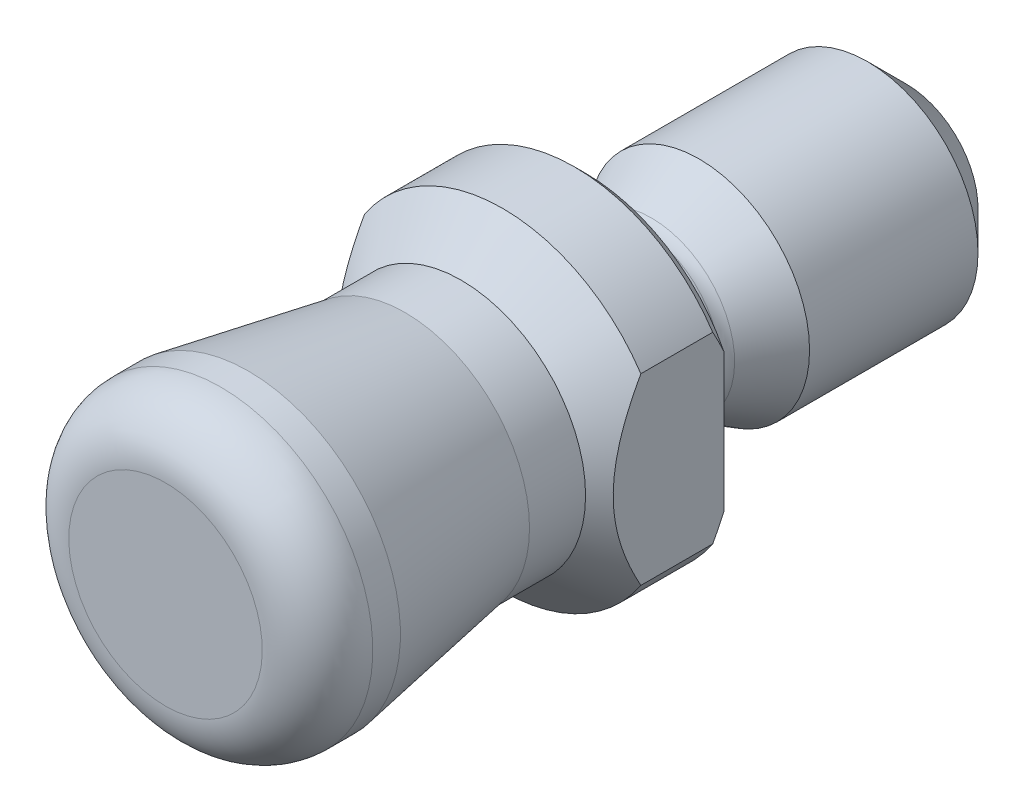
ISO-10303-21;
HEADER;
FILE_DESCRIPTION(('STEP AP214'),'2;1');
FILE_NAME('part.step','',(''),(''),'','','');
FILE_SCHEMA(('AUTOMOTIVE_DESIGN { 1 0 10303 214 1 1 1 1 }'));
ENDSEC;
DATA;
#1=APPLICATION_CONTEXT('core data for automotive mechanical design processes');
#2=APPLICATION_PROTOCOL_DEFINITION('international standard','automotive_design',2000,#1);
#3=PRODUCT_CONTEXT('',#1,'mechanical');
#4=PRODUCT('Part','Part','',(#3));
#5=PRODUCT_RELATED_PRODUCT_CATEGORY('part','',(#4));
#6=PRODUCT_DEFINITION_FORMATION('','',#4);
#7=PRODUCT_DEFINITION_CONTEXT('part definition',#1,'design');
#8=PRODUCT_DEFINITION('design','',#6,#7);
#9=PRODUCT_DEFINITION_SHAPE('','',#8);
#10=(LENGTH_UNIT() NAMED_UNIT(*) SI_UNIT(.MILLI.,.METRE.));
#11=(NAMED_UNIT(*) PLANE_ANGLE_UNIT() SI_UNIT($,.RADIAN.));
#12=(NAMED_UNIT(*) SI_UNIT($,.STERADIAN.) SOLID_ANGLE_UNIT());
#13=UNCERTAINTY_MEASURE_WITH_UNIT(LENGTH_MEASURE(1.E-05),#10,'distance_accuracy_value','');
#14=(GEOMETRIC_REPRESENTATION_CONTEXT(3) GLOBAL_UNCERTAINTY_ASSIGNED_CONTEXT((#13)) GLOBAL_UNIT_ASSIGNED_CONTEXT((#10,
#11,#12)) REPRESENTATION_CONTEXT('',''));
#15=CARTESIAN_POINT('',(0.,0.,0.));
#16=DIRECTION('',(0.,0.,1.));
#17=DIRECTION('',(1.,0.,0.));
#18=AXIS2_PLACEMENT_3D('',#15,#16,#17);
#19=CARTESIAN_POINT('',(0.,0.,0.));
#20=DIRECTION('',(0.,0.,-1.));
#21=DIRECTION('',(0.,1.,0.));
#22=AXIS2_PLACEMENT_3D('',#19,#20,#21);
#23=CYLINDRICAL_SURFACE('',#22,3.);
#24=DIRECTION('',(0.,0.,-1.));
#25=VECTOR('',#24,1.);
#26=CARTESIAN_POINT('',(2.5,1.6583123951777,7.601));
#27=LINE('',#26,#25);
#28=CARTESIAN_POINT('',(2.5,1.6583123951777,1.5));
#29=VERTEX_POINT('',#28);
#30=CARTESIAN_POINT('',(2.5,1.6583123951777,0.200000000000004));
#31=VERTEX_POINT('',#30);
#32=EDGE_CURVE('E72',#29,#31,#27,.T.);
#33=ORIENTED_EDGE('',*,*,#32,.T.);
#34=CARTESIAN_POINT('',(0.,0.,0.200000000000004));
#35=DIRECTION('',(0.,0.,-1.));
#36=DIRECTION('',(0.,1.,0.));
#37=AXIS2_PLACEMENT_3D('',#34,#35,#36);
#38=CIRCLE('',#37,3.);
#39=CARTESIAN_POINT('',(-2.5,1.6583123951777,0.200000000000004));
#40=VERTEX_POINT('',#39);
#41=EDGE_CURVE('E111',#31,#40,#38,.F.);
#42=ORIENTED_EDGE('',*,*,#41,.T.);
#43=DIRECTION('',(0.,0.,-1.));
#44=VECTOR('',#43,1.);
#45=CARTESIAN_POINT('',(-2.5,1.6583123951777,7.601));
#46=LINE('',#45,#44);
#47=CARTESIAN_POINT('',(-2.5,1.6583123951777,1.5));
#48=VERTEX_POINT('',#47);
#49=EDGE_CURVE('E264',#48,#40,#46,.T.);
#50=ORIENTED_EDGE('',*,*,#49,.F.);
#51=CARTESIAN_POINT('',(0.,0.,1.5));
#52=DIRECTION('',(0.,0.,-1.));
#53=DIRECTION('',(0.,1.,0.));
#54=AXIS2_PLACEMENT_3D('',#51,#52,#53);
#55=CIRCLE('',#54,3.);
#56=EDGE_CURVE('E92',#48,#29,#55,.T.);
#57=ORIENTED_EDGE('',*,*,#56,.T.);
#58=EDGE_LOOP('',(#33,#42,#50,#57));
#59=FACE_BOUND('',#58,.T.);
#60=ADVANCED_FACE('F14',(#59),#23,.T.);
#61=CARTESIAN_POINT('',(0.,0.,0.));
#62=DIRECTION('',(0.,0.,1.));
#63=DIRECTION('',(0.,-1.,0.));
#64=AXIS2_PLACEMENT_3D('',#61,#62,#63);
#65=CONICAL_SURFACE('',#64,2.8,0.785398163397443);
#66=CARTESIAN_POINT('',(2.5,3.65210212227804,1.62581629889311));
#67=CARTESIAN_POINT('',(2.5,3.58719697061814,1.5722604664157));
#68=CARTESIAN_POINT('',(2.5,3.52207125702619,1.51897223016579));
#69=CARTESIAN_POINT('',(2.5,3.39131181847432,1.41301848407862));
#70=CARTESIAN_POINT('',(2.5,3.32567807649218,1.36035299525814));
#71=CARTESIAN_POINT('',(2.5,3.12775823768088,1.20329815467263));
#72=CARTESIAN_POINT('',(2.5,2.99461351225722,1.09998314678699));
#73=CARTESIAN_POINT('',(2.5,2.72230319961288,0.894958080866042));
#74=CARTESIAN_POINT('',(2.5,2.5830695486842,0.793338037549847));
#75=CARTESIAN_POINT('',(2.5,2.30057116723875,0.595935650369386));
#76=CARTESIAN_POINT('',(2.5,2.15730851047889,0.500150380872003));
#77=CARTESIAN_POINT('',(2.5,1.91770666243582,0.349969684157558));
#78=CARTESIAN_POINT('',(2.5,1.8229582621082,0.293046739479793));
#79=CARTESIAN_POINT('',(2.5,1.63082812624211,0.183847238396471));
#80=CARTESIAN_POINT('',(2.5,1.53344711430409,0.131569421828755));
#81=CARTESIAN_POINT('',(2.5,1.33609486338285,0.0333478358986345));
#82=CARTESIAN_POINT('',(2.5,1.23613837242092,-0.0126252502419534));
#83=CARTESIAN_POINT('',(2.5,1.03292052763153,-0.096598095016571));
#84=CARTESIAN_POINT('',(2.5,0.929661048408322,-0.134602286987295));
#85=CARTESIAN_POINT('',(2.5,0.752251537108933,-0.19018365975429));
#86=CARTESIAN_POINT('',(2.5,0.678945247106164,-0.210445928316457));
#87=CARTESIAN_POINT('',(2.5,0.530994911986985,-0.245241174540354));
#88=CARTESIAN_POINT('',(2.5,0.456351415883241,-0.259776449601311));
#89=CARTESIAN_POINT('',(2.5,0.306286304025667,-0.282396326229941));
#90=CARTESIAN_POINT('',(2.5,0.230867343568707,-0.290498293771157));
#91=CARTESIAN_POINT('',(2.5,0.0796017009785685,-0.299871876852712));
#92=CARTESIAN_POINT('',(2.5,0.00375503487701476,-0.301143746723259));
#93=CARTESIAN_POINT('',(2.5,-0.14781059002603,-0.296781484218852));
#94=CARTESIAN_POINT('',(2.5,-0.223529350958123,-0.291140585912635));
#95=CARTESIAN_POINT('',(2.5,-0.374177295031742,-0.273260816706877));
#96=CARTESIAN_POINT('',(2.5,-0.449106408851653,-0.261021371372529));
#97=CARTESIAN_POINT('',(2.5,-0.597977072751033,-0.230516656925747));
#98=CARTESIAN_POINT('',(2.5,-0.671914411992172,-0.2122310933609));
#99=CARTESIAN_POINT('',(2.5,-0.818269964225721,-0.170427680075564));
#100=CARTESIAN_POINT('',(2.5,-0.890688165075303,-0.146909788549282));
#101=CARTESIAN_POINT('',(2.5,-1.13136551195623,-0.060470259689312));
#102=CARTESIAN_POINT('',(2.5,-1.2960224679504,0.0125414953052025));
#103=CARTESIAN_POINT('',(2.5,-1.53692256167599,0.133825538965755));
#104=CARTESIAN_POINT('',(2.5,-1.61630311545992,0.176274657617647));
#105=CARTESIAN_POINT('',(2.5,-1.77328070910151,0.264360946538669));
#106=CARTESIAN_POINT('',(2.5,-1.8508780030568,0.309997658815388));
#107=CARTESIAN_POINT('',(2.5,-2.08233159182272,0.45131226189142));
#108=CARTESIAN_POINT('',(2.5,-2.23381562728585,0.550853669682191));
#109=CARTESIAN_POINT('',(2.5,-2.53193663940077,0.756562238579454));
#110=CARTESIAN_POINT('',(2.5,-2.67857782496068,0.862723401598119));
#111=CARTESIAN_POINT('',(2.5,-2.96517803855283,1.07730148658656));
#112=CARTESIAN_POINT('',(2.5,-3.10521310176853,1.18561733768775));
#113=CARTESIAN_POINT('',(2.5,-3.31257110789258,1.34986608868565));
#114=CARTESIAN_POINT('',(2.5,-3.38085723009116,1.40459262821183));
#115=CARTESIAN_POINT('',(2.5,-3.51687567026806,1.51472184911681));
#116=CARTESIAN_POINT('',(2.5,-3.58460802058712,1.5701244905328));
#117=CARTESIAN_POINT('',(2.5,-3.65210212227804,1.62581629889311));
#118=B_SPLINE_CURVE_WITH_KNOTS('',3,(#66,#67,#68,#69,#70,#71,#72,#73,#74,#75,#76,#77,#78,#79,
#80,#81,#82,#83,#84,#85,#86,#87,#88,#89,#90,#91,#92,#93,#94,#95,#96,#97,#98,#99,#100,#101,#102,
#103,#104,#105,#106,#107,#108,#109,#110,#111,#112,#113,#114,#115,#116,#117),.UNSPECIFIED.,.F.,
.F.,(4,2,2,2,2,2,2,2,2,2,2,2,2,2,2,2,2,2,2,2,2,2,2,2,2,4),(0.,0.252442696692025,
0.504893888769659,1.01041976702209,1.52744877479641,2.0442163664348,2.37571893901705,
2.70713130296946,3.03694619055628,3.36657710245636,3.5945495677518,3.82243048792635,
4.04969415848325,4.27694936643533,4.50442718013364,4.73192480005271,4.96019392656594,
5.18846487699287,5.7271869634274,5.99721927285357,6.26721286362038,6.81069224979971,
7.35368615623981,7.88472932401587,8.14725613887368,8.40976751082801),.UNSPECIFIED.);
#119=CARTESIAN_POINT('',(2.5,-1.26095202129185,0.));
#120=VERTEX_POINT('',#119);
#121=CARTESIAN_POINT('',(2.5,-1.6583123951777,0.200000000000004));
#122=VERTEX_POINT('',#121);
#123=EDGE_CURVE('E233',#120,#122,#118,.T.);
#124=ORIENTED_EDGE('',*,*,#123,.T.);
#125=CARTESIAN_POINT('',(-2.5,-1.6583123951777,0.200000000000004));
#126=VERTEX_POINT('',#125);
#127=EDGE_CURVE('E86',#126,#122,#38,.F.);
#128=ORIENTED_EDGE('',*,*,#127,.F.);
#129=CARTESIAN_POINT('',(-2.5,-3.65210212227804,1.62581629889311));
#130=CARTESIAN_POINT('',(-2.5,-3.58719697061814,1.5722604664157));
#131=CARTESIAN_POINT('',(-2.5,-3.52207125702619,1.51897223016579));
#132=CARTESIAN_POINT('',(-2.5,-3.39131181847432,1.41301848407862));
#133=CARTESIAN_POINT('',(-2.5,-3.32567807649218,1.36035299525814));
#134=CARTESIAN_POINT('',(-2.5,-3.12775823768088,1.20329815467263));
#135=CARTESIAN_POINT('',(-2.5,-2.99461351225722,1.09998314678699));
#136=CARTESIAN_POINT('',(-2.5,-2.72230319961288,0.894958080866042));
#137=CARTESIAN_POINT('',(-2.5,-2.5830695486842,0.793338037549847));
#138=CARTESIAN_POINT('',(-2.5,-2.30057116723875,0.595935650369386));
#139=CARTESIAN_POINT('',(-2.5,-2.15730851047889,0.500150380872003));
#140=CARTESIAN_POINT('',(-2.5,-1.91770666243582,0.349969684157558));
#141=CARTESIAN_POINT('',(-2.5,-1.8229582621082,0.293046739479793));
#142=CARTESIAN_POINT('',(-2.5,-1.63082812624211,0.183847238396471));
#143=CARTESIAN_POINT('',(-2.5,-1.53344711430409,0.131569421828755));
#144=CARTESIAN_POINT('',(-2.5,-1.33609486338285,0.0333478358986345));
#145=CARTESIAN_POINT('',(-2.5,-1.23613837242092,-0.0126252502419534));
#146=CARTESIAN_POINT('',(-2.5,-1.03292052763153,-0.096598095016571));
#147=CARTESIAN_POINT('',(-2.5,-0.929661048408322,-0.134602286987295));
#148=CARTESIAN_POINT('',(-2.5,-0.752251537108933,-0.19018365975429));
#149=CARTESIAN_POINT('',(-2.5,-0.678945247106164,-0.210445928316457));
#150=CARTESIAN_POINT('',(-2.5,-0.530994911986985,-0.245241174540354));
#151=CARTESIAN_POINT('',(-2.5,-0.456351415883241,-0.259776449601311));
#152=CARTESIAN_POINT('',(-2.5,-0.306286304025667,-0.282396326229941));
#153=CARTESIAN_POINT('',(-2.5,-0.230867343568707,-0.290498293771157));
#154=CARTESIAN_POINT('',(-2.5,-0.0796017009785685,-0.299871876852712));
#155=CARTESIAN_POINT('',(-2.5,-0.00375503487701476,-0.301143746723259));
#156=CARTESIAN_POINT('',(-2.5,0.14781059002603,-0.296781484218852));
#157=CARTESIAN_POINT('',(-2.5,0.223529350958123,-0.291140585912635));
#158=CARTESIAN_POINT('',(-2.5,0.374177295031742,-0.273260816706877));
#159=CARTESIAN_POINT('',(-2.5,0.449106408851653,-0.261021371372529));
#160=CARTESIAN_POINT('',(-2.5,0.597977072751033,-0.230516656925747));
#161=CARTESIAN_POINT('',(-2.5,0.671914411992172,-0.2122310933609));
#162=CARTESIAN_POINT('',(-2.5,0.818269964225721,-0.170427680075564));
#163=CARTESIAN_POINT('',(-2.5,0.890688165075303,-0.146909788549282));
#164=CARTESIAN_POINT('',(-2.5,1.13136551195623,-0.060470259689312));
#165=CARTESIAN_POINT('',(-2.5,1.2960224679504,0.0125414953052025));
#166=CARTESIAN_POINT('',(-2.5,1.53692256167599,0.133825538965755));
#167=CARTESIAN_POINT('',(-2.5,1.61630311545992,0.176274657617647));
#168=CARTESIAN_POINT('',(-2.5,1.77328070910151,0.264360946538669));
#169=CARTESIAN_POINT('',(-2.5,1.8508780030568,0.309997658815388));
#170=CARTESIAN_POINT('',(-2.5,2.08233159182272,0.45131226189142));
#171=CARTESIAN_POINT('',(-2.5,2.23381562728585,0.550853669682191));
#172=CARTESIAN_POINT('',(-2.5,2.53193663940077,0.756562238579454));
#173=CARTESIAN_POINT('',(-2.5,2.67857782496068,0.862723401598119));
#174=CARTESIAN_POINT('',(-2.5,2.96517803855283,1.07730148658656));
#175=CARTESIAN_POINT('',(-2.5,3.10521310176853,1.18561733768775));
#176=CARTESIAN_POINT('',(-2.5,3.31257110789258,1.34986608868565));
#177=CARTESIAN_POINT('',(-2.5,3.38085723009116,1.40459262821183));
#178=CARTESIAN_POINT('',(-2.5,3.51687567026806,1.51472184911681));
#179=CARTESIAN_POINT('',(-2.5,3.58460802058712,1.5701244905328));
#180=CARTESIAN_POINT('',(-2.5,3.65210212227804,1.62581629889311));
#181=B_SPLINE_CURVE_WITH_KNOTS('',3,(#129,#130,#131,#132,#133,#134,#135,#136,#137,#138,#139,
#140,#141,#142,#143,#144,#145,#146,#147,#148,#149,#150,#151,#152,#153,#154,#155,#156,#157,#158,
#159,#160,#161,#162,#163,#164,#165,#166,#167,#168,#169,#170,#171,#172,#173,#174,#175,#176,#177,
#178,#179,#180),.UNSPECIFIED.,.F.,.F.,(4,2,2,2,2,2,2,2,2,2,2,2,2,2,2,2,2,2,2,2,2,2,2,2,2,4),(0.,
0.252442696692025,0.504893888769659,1.01041976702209,1.52744877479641,2.0442163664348,
2.37571893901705,2.70713130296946,3.03694619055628,3.36657710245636,3.5945495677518,
3.82243048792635,4.04969415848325,4.27694936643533,4.50442718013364,4.73192480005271,
4.96019392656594,5.18846487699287,5.7271869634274,5.99721927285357,6.26721286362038,
6.81069224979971,7.35368615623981,7.88472932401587,8.14725613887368,8.40976751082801),.UNSPECIFIED.);
#182=CARTESIAN_POINT('',(-2.5,-1.26095202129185,0.));
#183=VERTEX_POINT('',#182);
#184=EDGE_CURVE('E252',#126,#183,#181,.T.);
#185=ORIENTED_EDGE('',*,*,#184,.T.);
#186=CARTESIAN_POINT('',(0.,0.,0.));
#187=DIRECTION('',(0.,0.,-1.));
#188=DIRECTION('',(0.,1.,0.));
#189=AXIS2_PLACEMENT_3D('',#186,#187,#188);
#190=CIRCLE('',#189,2.8);
#191=EDGE_CURVE('E36',#120,#183,#190,.T.);
#192=ORIENTED_EDGE('',*,*,#191,.F.);
#193=EDGE_LOOP('',(#124,#128,#185,#192));
#194=FACE_BOUND('',#193,.T.);
#195=ADVANCED_FACE('F161',(#194),#65,.T.);
#196=CARTESIAN_POINT('',(2.75,0.,7.6));
#197=DIRECTION('',(0.,0.,1.));
#198=DIRECTION('',(0.,-1.,0.));
#199=AXIS2_PLACEMENT_3D('',#196,#197,#198);
#200=PLANE('',#199);
#201=CARTESIAN_POINT('',(0.,0.,7.6));
#202=DIRECTION('',(0.,0.,1.));
#203=DIRECTION('',(0.,-1.,0.));
#204=AXIS2_PLACEMENT_3D('',#201,#202,#203);
#205=CIRCLE('',#204,1.75);
#206=CARTESIAN_POINT('',(0.,-1.75,7.6));
#207=VERTEX_POINT('',#206);
#208=EDGE_CURVE('E122',#207,#207,#205,.T.);
#209=ORIENTED_EDGE('',*,*,#208,.T.);
#210=EDGE_LOOP('',(#209));
#211=FACE_BOUND('',#210,.T.);
#212=ADVANCED_FACE('F167',(#211),#200,.T.);
#213=CARTESIAN_POINT('',(0.,0.,0.));
#214=DIRECTION('',(0.,0.,-1.));
#215=DIRECTION('',(0.,1.,0.));
#216=AXIS2_PLACEMENT_3D('',#213,#214,#215);
#217=CYLINDRICAL_SURFACE('',#216,2.75);
#218=CARTESIAN_POINT('',(0.,0.,6.6));
#219=DIRECTION('',(0.,0.,1.));
#220=DIRECTION('',(0.,-1.,0.));
#221=AXIS2_PLACEMENT_3D('',#218,#219,#220);
#222=CIRCLE('',#221,2.75);
#223=CARTESIAN_POINT('',(0.,-2.75,6.6));
#224=VERTEX_POINT('',#223);
#225=EDGE_CURVE('E119',#224,#224,#222,.F.);
#226=ORIENTED_EDGE('',*,*,#225,.T.);
#227=EDGE_LOOP('',(#226));
#228=FACE_BOUND('',#227,.T.);
#229=CARTESIAN_POINT('',(0.,0.,6.1));
#230=DIRECTION('',(0.,0.,-1.));
#231=DIRECTION('',(0.,1.,0.));
#232=AXIS2_PLACEMENT_3D('',#229,#230,#231);
#233=CIRCLE('',#232,2.75);
#234=CARTESIAN_POINT('',(0.,2.75,6.1));
#235=VERTEX_POINT('',#234);
#236=EDGE_CURVE('E105',#235,#235,#233,.T.);
#237=ORIENTED_EDGE('',*,*,#236,.F.);
#238=EDGE_LOOP('',(#237));
#239=FACE_BOUND('',#238,.T.);
#240=ADVANCED_FACE('F189',(#228,#239),#217,.T.);
#241=CARTESIAN_POINT('',(0.,0.,3.26435909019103));
#242=DIRECTION('',(0.,0.,1.));
#243=DIRECTION('',(0.,-1.,0.));
#244=AXIS2_PLACEMENT_3D('',#241,#242,#243);
#245=CONICAL_SURFACE('',#244,2.25,0.174532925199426);
#246=ORIENTED_EDGE('',*,*,#236,.T.);
#247=EDGE_LOOP('',(#246));
#248=FACE_BOUND('',#247,.T.);
#249=CARTESIAN_POINT('',(0.,0.,3.26435909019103));
#250=DIRECTION('',(0.,0.,-1.));
#251=DIRECTION('',(0.,1.,0.));
#252=AXIS2_PLACEMENT_3D('',#249,#250,#251);
#253=CIRCLE('',#252,2.25);
#254=CARTESIAN_POINT('',(0.,2.25,3.26435909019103));
#255=VERTEX_POINT('',#254);
#256=EDGE_CURVE('E102',#255,#255,#253,.T.);
#257=ORIENTED_EDGE('',*,*,#256,.F.);
#258=EDGE_LOOP('',(#257));
#259=FACE_BOUND('',#258,.T.);
#260=ADVANCED_FACE('F183',(#248,#259),#245,.T.);
#261=CARTESIAN_POINT('',(0.,0.,0.));
#262=DIRECTION('',(0.,0.,-1.));
#263=DIRECTION('',(0.,1.,0.));
#264=AXIS2_PLACEMENT_3D('',#261,#262,#263);
#265=CYLINDRICAL_SURFACE('',#264,2.25);
#266=ORIENTED_EDGE('',*,*,#256,.T.);
#267=EDGE_LOOP('',(#266));
#268=FACE_BOUND('',#267,.T.);
#269=CARTESIAN_POINT('',(0.,0.,2.25));
#270=DIRECTION('',(0.,0.,-1.));
#271=DIRECTION('',(0.,1.,0.));
#272=AXIS2_PLACEMENT_3D('',#269,#270,#271);
#273=CIRCLE('',#272,2.25);
#274=CARTESIAN_POINT('',(0.,2.25,2.25));
#275=VERTEX_POINT('',#274);
#276=EDGE_CURVE('E95',#275,#275,#273,.T.);
#277=ORIENTED_EDGE('',*,*,#276,.F.);
#278=EDGE_LOOP('',(#277));
#279=FACE_BOUND('',#278,.T.);
#280=ADVANCED_FACE('F179',(#268,#279),#265,.T.);
#281=CARTESIAN_POINT('',(0.,0.,1.5));
#282=DIRECTION('',(0.,0.,-1.));
#283=DIRECTION('',(0.,1.,0.));
#284=AXIS2_PLACEMENT_3D('',#281,#282,#283);
#285=CONICAL_SURFACE('',#284,3.,0.785398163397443);
#286=CARTESIAN_POINT('',(2.5,3.27726445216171,0.378051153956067));
#287=CARTESIAN_POINT('',(2.5,3.19893488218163,0.440315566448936));
#288=CARTESIAN_POINT('',(2.5,3.12021452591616,0.502095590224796));
#289=CARTESIAN_POINT('',(2.5,2.9618221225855,0.62445727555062));
#290=CARTESIAN_POINT('',(2.5,2.88214987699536,0.68503867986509));
#291=CARTESIAN_POINT('',(2.5,2.72110770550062,0.805201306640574));
#292=CARTESIAN_POINT('',(2.5,2.63972948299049,0.864771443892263));
#293=CARTESIAN_POINT('',(2.5,2.47567605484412,0.98209121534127));
#294=CARTESIAN_POINT('',(2.5,2.39300093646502,1.03984097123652));
#295=CARTESIAN_POINT('',(2.5,2.21990270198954,1.15730237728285));
#296=CARTESIAN_POINT('',(2.5,2.1293609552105,1.21684005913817));
#297=CARTESIAN_POINT('',(2.5,1.94614460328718,1.33259829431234));
#298=CARTESIAN_POINT('',(2.5,1.85346960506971,1.38881822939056));
#299=CARTESIAN_POINT('',(2.5,1.66589851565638,1.49677649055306));
#300=CARTESIAN_POINT('',(2.5,1.57100998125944,1.54852784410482));
#301=CARTESIAN_POINT('',(2.5,1.37839064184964,1.64639127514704));
#302=CARTESIAN_POINT('',(2.5,1.28066130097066,1.69250619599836));
#303=CARTESIAN_POINT('',(2.5,1.09486338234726,1.77188357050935));
#304=CARTESIAN_POINT('',(2.5,1.00717922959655,1.80603685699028));
#305=CARTESIAN_POINT('',(2.5,0.829351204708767,1.8673465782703));
#306=CARTESIAN_POINT('',(2.5,0.739207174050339,1.89450256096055));
#307=CARTESIAN_POINT('',(2.5,0.55846870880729,1.93984554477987));
#308=CARTESIAN_POINT('',(2.5,0.467915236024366,1.95819287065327));
#309=CARTESIAN_POINT('',(2.5,0.285383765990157,1.98537959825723));
#310=CARTESIAN_POINT('',(2.5,0.19340619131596,1.99422176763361));
#311=CARTESIAN_POINT('',(2.5,0.014285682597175,2.00146921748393));
#312=CARTESIAN_POINT('',(2.5,-0.0728342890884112,2.00044017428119));
#313=CARTESIAN_POINT('',(2.5,-0.246492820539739,1.98937322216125));
#314=CARTESIAN_POINT('',(2.5,-0.333031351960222,1.97933487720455));
#315=CARTESIAN_POINT('',(2.5,-0.505392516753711,1.95085704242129));
#316=CARTESIAN_POINT('',(2.5,-0.591204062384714,1.93235168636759));
#317=CARTESIAN_POINT('',(2.5,-0.760903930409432,1.88805411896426));
#318=CARTESIAN_POINT('',(2.5,-0.844791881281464,1.86226051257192));
#319=CARTESIAN_POINT('',(2.5,-1.08955045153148,1.77713049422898));
#320=CARTESIAN_POINT('',(2.5,-1.24744813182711,1.70928199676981));
#321=CARTESIAN_POINT('',(2.5,-1.55586205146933,1.5584804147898));
#322=CARTESIAN_POINT('',(2.5,-1.7063641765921,1.47549977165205));
#323=CARTESIAN_POINT('',(2.5,-2.00331470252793,1.29860945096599));
#324=CARTESIAN_POINT('',(2.5,-2.14968774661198,1.2045748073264));
#325=CARTESIAN_POINT('',(2.5,-2.36570871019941,1.05851796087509));
#326=CARTESIAN_POINT('',(2.5,-2.43709715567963,1.00901968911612));
#327=CARTESIAN_POINT('',(2.5,-2.57887382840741,0.908610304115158));
#328=CARTESIAN_POINT('',(2.5,-2.6492620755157,0.85769921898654));
#329=CARTESIAN_POINT('',(2.5,-2.83132460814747,0.723675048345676));
#330=CARTESIAN_POINT('',(2.5,-2.94232082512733,0.639642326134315));
#331=CARTESIAN_POINT('',(2.5,-3.16253328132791,0.469271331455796));
#332=CARTESIAN_POINT('',(2.5,-3.27174939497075,0.382932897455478));
#333=CARTESIAN_POINT('',(2.5,-3.59730135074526,0.121211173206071));
#334=CARTESIAN_POINT('',(2.5,-3.81148972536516,-0.0568401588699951));
#335=CARTESIAN_POINT('',(2.5,-4.23632570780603,-0.417722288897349));
#336=CARTESIAN_POINT('',(2.5,-4.44696744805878,-0.600559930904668));
#337=CARTESIAN_POINT('',(2.5,-4.86549350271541,-0.969299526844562));
#338=CARTESIAN_POINT('',(2.5,-5.07337820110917,-1.15520104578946));
#339=CARTESIAN_POINT('',(2.5,-5.46997139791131,-1.51365329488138));
#340=CARTESIAN_POINT('',(2.5,-5.65883788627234,-1.68602973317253));
#341=CARTESIAN_POINT('',(2.5,-6.03529979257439,-2.03217989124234));
#342=CARTESIAN_POINT('',(2.5,-6.22289515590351,-2.20595367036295));
#343=CARTESIAN_POINT('',(2.5,-6.59652906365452,-2.55404768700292));
#344=CARTESIAN_POINT('',(2.5,-6.78257058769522,-2.72836473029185));
#345=CARTESIAN_POINT('',(2.5,-7.15384259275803,-3.07783708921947));
#346=CARTESIAN_POINT('',(2.5,-7.33907312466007,-3.25299235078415));
#347=CARTESIAN_POINT('',(2.5,-7.52399978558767,-3.42846597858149));
#348=B_SPLINE_CURVE_WITH_KNOTS('',3,(#286,#287,#288,#289,#290,#291,#292,#293,#294,#295,#296,
#297,#298,#299,#300,#301,#302,#303,#304,#305,#306,#307,#308,#309,#310,#311,#312,#313,#314,#315,
#316,#317,#318,#319,#320,#321,#322,#323,#324,#325,#326,#327,#328,#329,#330,#331,#332,#333,#334,
#335,#336,#337,#338,#339,#340,#341,#342,#343,#344,#345,#346,#347),.UNSPECIFIED.,.F.,.F.,(4,2,2,
2,2,2,2,2,2,2,2,2,2,2,2,2,2,2,2,2,2,2,2,2,2,2,2,2,2,2,4),(0.,0.300190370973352,
0.600444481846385,0.902978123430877,1.20549149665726,1.53052406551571,1.85561701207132,
2.17972772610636,2.50367425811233,2.78574125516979,3.06782647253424,3.34456211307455,
3.62121715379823,3.88211747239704,4.14303041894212,4.40600849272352,4.66903693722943,
5.18320533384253,5.69831965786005,6.21994974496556,6.48054946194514,6.74114399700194,
7.15875591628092,7.57639716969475,8.41187124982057,9.24861340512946,10.0852377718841,
10.8523396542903,11.6194742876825,12.3843119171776,13.1491008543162),.UNSPECIFIED.);
#349=CARTESIAN_POINT('',(2.5,-1.6583123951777,1.5));
#350=VERTEX_POINT('',#349);
#351=EDGE_CURVE('E66',#350,#29,#348,.F.);
#352=ORIENTED_EDGE('',*,*,#351,.T.);
#353=ORIENTED_EDGE('',*,*,#56,.F.);
#354=CARTESIAN_POINT('',(-2.5,3.27726445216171,0.378051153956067));
#355=CARTESIAN_POINT('',(-2.5,3.19893488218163,0.440315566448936));
#356=CARTESIAN_POINT('',(-2.5,3.12021452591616,0.502095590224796));
#357=CARTESIAN_POINT('',(-2.5,2.9618221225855,0.62445727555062));
#358=CARTESIAN_POINT('',(-2.5,2.88214987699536,0.68503867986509));
#359=CARTESIAN_POINT('',(-2.5,2.72110770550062,0.805201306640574));
#360=CARTESIAN_POINT('',(-2.5,2.63972948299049,0.864771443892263));
#361=CARTESIAN_POINT('',(-2.5,2.47567605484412,0.98209121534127));
#362=CARTESIAN_POINT('',(-2.5,2.39300093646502,1.03984097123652));
#363=CARTESIAN_POINT('',(-2.5,2.21990270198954,1.15730237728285));
#364=CARTESIAN_POINT('',(-2.5,2.1293609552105,1.21684005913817));
#365=CARTESIAN_POINT('',(-2.5,1.94614460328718,1.33259829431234));
#366=CARTESIAN_POINT('',(-2.5,1.85346960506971,1.38881822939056));
#367=CARTESIAN_POINT('',(-2.5,1.66589851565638,1.49677649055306));
#368=CARTESIAN_POINT('',(-2.5,1.57100998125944,1.54852784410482));
#369=CARTESIAN_POINT('',(-2.5,1.37839064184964,1.64639127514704));
#370=CARTESIAN_POINT('',(-2.5,1.28066130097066,1.69250619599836));
#371=CARTESIAN_POINT('',(-2.5,1.09486338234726,1.77188357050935));
#372=CARTESIAN_POINT('',(-2.5,1.00717922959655,1.80603685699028));
#373=CARTESIAN_POINT('',(-2.5,0.829351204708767,1.8673465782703));
#374=CARTESIAN_POINT('',(-2.5,0.739207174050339,1.89450256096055));
#375=CARTESIAN_POINT('',(-2.5,0.55846870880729,1.93984554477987));
#376=CARTESIAN_POINT('',(-2.5,0.467915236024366,1.95819287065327));
#377=CARTESIAN_POINT('',(-2.5,0.285383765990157,1.98537959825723));
#378=CARTESIAN_POINT('',(-2.5,0.19340619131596,1.99422176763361));
#379=CARTESIAN_POINT('',(-2.5,0.014285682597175,2.00146921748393));
#380=CARTESIAN_POINT('',(-2.5,-0.0728342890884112,2.00044017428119));
#381=CARTESIAN_POINT('',(-2.5,-0.246492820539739,1.98937322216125));
#382=CARTESIAN_POINT('',(-2.5,-0.333031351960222,1.97933487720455));
#383=CARTESIAN_POINT('',(-2.5,-0.505392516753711,1.95085704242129));
#384=CARTESIAN_POINT('',(-2.5,-0.591204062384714,1.93235168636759));
#385=CARTESIAN_POINT('',(-2.5,-0.760903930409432,1.88805411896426));
#386=CARTESIAN_POINT('',(-2.5,-0.844791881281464,1.86226051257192));
#387=CARTESIAN_POINT('',(-2.5,-1.08955045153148,1.77713049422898));
#388=CARTESIAN_POINT('',(-2.5,-1.24744813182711,1.70928199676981));
#389=CARTESIAN_POINT('',(-2.5,-1.55586205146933,1.5584804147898));
#390=CARTESIAN_POINT('',(-2.5,-1.7063641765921,1.47549977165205));
#391=CARTESIAN_POINT('',(-2.5,-2.00331470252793,1.29860945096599));
#392=CARTESIAN_POINT('',(-2.5,-2.14968774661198,1.2045748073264));
#393=CARTESIAN_POINT('',(-2.5,-2.36570871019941,1.05851796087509));
#394=CARTESIAN_POINT('',(-2.5,-2.43709715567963,1.00901968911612));
#395=CARTESIAN_POINT('',(-2.5,-2.57887382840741,0.908610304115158));
#396=CARTESIAN_POINT('',(-2.5,-2.6492620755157,0.85769921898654));
#397=CARTESIAN_POINT('',(-2.5,-2.83132460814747,0.723675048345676));
#398=CARTESIAN_POINT('',(-2.5,-2.94232082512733,0.639642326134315));
#399=CARTESIAN_POINT('',(-2.5,-3.16253328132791,0.469271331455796));
#400=CARTESIAN_POINT('',(-2.5,-3.27174939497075,0.382932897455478));
#401=CARTESIAN_POINT('',(-2.5,-3.59730135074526,0.121211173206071));
#402=CARTESIAN_POINT('',(-2.5,-3.81148972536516,-0.0568401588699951));
#403=CARTESIAN_POINT('',(-2.5,-4.23632570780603,-0.417722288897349));
#404=CARTESIAN_POINT('',(-2.5,-4.44696744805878,-0.600559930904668));
#405=CARTESIAN_POINT('',(-2.5,-4.86549350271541,-0.969299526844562));
#406=CARTESIAN_POINT('',(-2.5,-5.07337820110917,-1.15520104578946));
#407=CARTESIAN_POINT('',(-2.5,-5.46997139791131,-1.51365329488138));
#408=CARTESIAN_POINT('',(-2.5,-5.65883788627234,-1.68602973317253));
#409=CARTESIAN_POINT('',(-2.5,-6.03529979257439,-2.03217989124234));
#410=CARTESIAN_POINT('',(-2.5,-6.22289515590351,-2.20595367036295));
#411=CARTESIAN_POINT('',(-2.5,-6.59652906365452,-2.55404768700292));
#412=CARTESIAN_POINT('',(-2.5,-6.78257058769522,-2.72836473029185));
#413=CARTESIAN_POINT('',(-2.5,-7.15384259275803,-3.07783708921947));
#414=CARTESIAN_POINT('',(-2.5,-7.33907312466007,-3.25299235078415));
#415=CARTESIAN_POINT('',(-2.5,-7.52399978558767,-3.42846597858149));
#416=B_SPLINE_CURVE_WITH_KNOTS('',3,(#354,#355,#356,#357,#358,#359,#360,#361,#362,#363,#364,
#365,#366,#367,#368,#369,#370,#371,#372,#373,#374,#375,#376,#377,#378,#379,#380,#381,#382,#383,
#384,#385,#386,#387,#388,#389,#390,#391,#392,#393,#394,#395,#396,#397,#398,#399,#400,#401,#402,
#403,#404,#405,#406,#407,#408,#409,#410,#411,#412,#413,#414,#415),.UNSPECIFIED.,.F.,.F.,(4,2,2,
2,2,2,2,2,2,2,2,2,2,2,2,2,2,2,2,2,2,2,2,2,2,2,2,2,2,2,4),(0.,0.300190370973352,
0.600444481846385,0.902978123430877,1.20549149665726,1.53052406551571,1.85561701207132,
2.17972772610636,2.50367425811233,2.78574125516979,3.06782647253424,3.34456211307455,
3.62121715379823,3.88211747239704,4.14303041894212,4.40600849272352,4.66903693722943,
5.18320533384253,5.69831965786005,6.21994974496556,6.48054946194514,6.74114399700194,
7.15875591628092,7.57639716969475,8.41187124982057,9.24861340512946,10.0852377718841,
10.8523396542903,11.6194742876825,12.3843119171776,13.1491008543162),.UNSPECIFIED.);
#417=CARTESIAN_POINT('',(-2.5,-1.6583123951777,1.5));
#418=VERTEX_POINT('',#417);
#419=EDGE_CURVE('E91',#48,#418,#416,.T.);
#420=ORIENTED_EDGE('',*,*,#419,.T.);
#421=EDGE_CURVE('E83',#350,#418,#55,.T.);
#422=ORIENTED_EDGE('',*,*,#421,.F.);
#423=EDGE_LOOP('',(#352,#353,#420,#422));
#424=FACE_BOUND('',#423,.T.);
#425=ORIENTED_EDGE('',*,*,#276,.T.);
#426=EDGE_LOOP('',(#425));
#427=FACE_BOUND('',#426,.T.);
#428=ADVANCED_FACE('F89',(#424,#427),#285,.T.);
#429=DIRECTION('',(0.,0.,-1.));
#430=VECTOR('',#429,1.);
#431=CARTESIAN_POINT('',(2.5,-1.6583123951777,7.601));
#432=LINE('',#431,#430);
#433=EDGE_CURVE('E69',#350,#122,#432,.T.);
#434=ORIENTED_EDGE('',*,*,#433,.F.);
#435=ORIENTED_EDGE('',*,*,#421,.T.);
#436=DIRECTION('',(0.,0.,-1.));
#437=VECTOR('',#436,1.);
#438=CARTESIAN_POINT('',(-2.5,-1.6583123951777,7.601));
#439=LINE('',#438,#437);
#440=EDGE_CURVE('E263',#418,#126,#439,.T.);
#441=ORIENTED_EDGE('',*,*,#440,.T.);
#442=ORIENTED_EDGE('',*,*,#127,.T.);
#443=EDGE_LOOP('',(#434,#435,#441,#442));
#444=FACE_BOUND('',#443,.T.);
#445=ADVANCED_FACE('F81',(#444),#23,.T.);
#446=CARTESIAN_POINT('',(3.,0.,0.));
#447=DIRECTION('',(0.,0.,-1.));
#448=DIRECTION('',(0.,1.,0.));
#449=AXIS2_PLACEMENT_3D('',#446,#447,#448);
#450=PLANE('',#449);
#451=CARTESIAN_POINT('',(0.,0.,0.));
#452=DIRECTION('',(0.,0.,-1.));
#453=DIRECTION('',(0.,1.,0.));
#454=AXIS2_PLACEMENT_3D('',#451,#452,#453);
#455=CIRCLE('',#454,1.85);
#456=CARTESIAN_POINT('',(0.,1.85,0.));
#457=VERTEX_POINT('',#456);
#458=EDGE_CURVE('E9',#457,#457,#455,.F.);
#459=ORIENTED_EDGE('',*,*,#458,.T.);
#460=EDGE_LOOP('',(#459));
#461=FACE_BOUND('',#460,.T.);
#462=DIRECTION('',(0.,1.,0.));
#463=VECTOR('',#462,1.);
#464=CARTESIAN_POINT('',(2.5,1.6583123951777,0.));
#465=LINE('',#464,#463);
#466=CARTESIAN_POINT('',(2.5,1.26095202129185,0.));
#467=VERTEX_POINT('',#466);
#468=EDGE_CURVE('E29',#120,#467,#465,.T.);
#469=ORIENTED_EDGE('',*,*,#468,.F.);
#470=ORIENTED_EDGE('',*,*,#191,.T.);
#471=DIRECTION('',(0.,-1.,0.));
#472=VECTOR('',#471,1.);
#473=CARTESIAN_POINT('',(-2.5,1.6583123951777,0.));
#474=LINE('',#473,#472);
#475=CARTESIAN_POINT('',(-2.5,1.26095202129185,0.));
#476=VERTEX_POINT('',#475);
#477=EDGE_CURVE('E253',#476,#183,#474,.T.);
#478=ORIENTED_EDGE('',*,*,#477,.F.);
#479=EDGE_CURVE('E108',#476,#467,#190,.T.);
#480=ORIENTED_EDGE('',*,*,#479,.T.);
#481=EDGE_LOOP('',(#469,#470,#478,#480));
#482=FACE_BOUND('',#481,.T.);
#483=ADVANCED_FACE('F173',(#461,#482),#450,.T.);
#484=CARTESIAN_POINT('',(0.,0.,0.));
#485=DIRECTION('',(0.,0.,-1.));
#486=DIRECTION('',(0.,1.,0.));
#487=AXIS2_PLACEMENT_3D('',#484,#485,#486);
#488=CYLINDRICAL_SURFACE('',#487,1.45);
#489=CARTESIAN_POINT('',(0.,0.,-0.99282032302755));
#490=DIRECTION('',(0.,0.,-1.));
#491=DIRECTION('',(0.,1.,0.));
#492=AXIS2_PLACEMENT_3D('',#489,#490,#491);
#493=CIRCLE('',#492,1.45);
#494=CARTESIAN_POINT('',(0.,1.45,-0.99282032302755));
#495=VERTEX_POINT('',#494);
#496=EDGE_CURVE('E22',#495,#495,#493,.F.);
#497=ORIENTED_EDGE('',*,*,#496,.T.);
#498=EDGE_LOOP('',(#497));
#499=FACE_BOUND('',#498,.T.);
#500=CARTESIAN_POINT('',(0.,0.,-0.4));
#501=DIRECTION('',(0.,0.,-1.));
#502=DIRECTION('',(0.,1.,0.));
#503=AXIS2_PLACEMENT_3D('',#500,#501,#502);
#504=CIRCLE('',#503,1.45);
#505=CARTESIAN_POINT('',(0.,1.45,-0.4));
#506=VERTEX_POINT('',#505);
#507=EDGE_CURVE('E128',#506,#506,#504,.T.);
#508=ORIENTED_EDGE('',*,*,#507,.T.);
#509=EDGE_LOOP('',(#508));
#510=FACE_BOUND('',#509,.T.);
#511=ADVANCED_FACE('F133',(#499,#510),#488,.T.);
#512=CARTESIAN_POINT('',(0.,0.,-2.05262794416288));
#513=DIRECTION('',(0.,0.,-1.));
#514=DIRECTION('',(0.,1.,0.));
#515=AXIS2_PLACEMENT_3D('',#512,#513,#514);
#516=CONICAL_SURFACE('',#515,2.,0.523598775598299);
#517=CARTESIAN_POINT('',(0.,0.,-1.19282032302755));
#518=DIRECTION('',(0.,0.,-1.));
#519=DIRECTION('',(0.,1.,0.));
#520=AXIS2_PLACEMENT_3D('',#517,#518,#519);
#521=CIRCLE('',#520,1.50358983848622);
#522=CARTESIAN_POINT('',(0.,1.50358983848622,-1.19282032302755));
#523=VERTEX_POINT('',#522);
#524=EDGE_CURVE('E125',#523,#523,#521,.T.);
#525=ORIENTED_EDGE('',*,*,#524,.T.);
#526=EDGE_LOOP('',(#525));
#527=FACE_BOUND('',#526,.T.);
#528=CARTESIAN_POINT('',(0.,0.,-2.05262794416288));
#529=DIRECTION('',(0.,0.,-1.));
#530=DIRECTION('',(0.,1.,0.));
#531=AXIS2_PLACEMENT_3D('',#528,#529,#530);
#532=CIRCLE('',#531,2.);
#533=CARTESIAN_POINT('',(0.,2.,-2.05262794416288));
#534=VERTEX_POINT('',#533);
#535=EDGE_CURVE('E93',#534,#534,#532,.T.);
#536=ORIENTED_EDGE('',*,*,#535,.F.);
#537=EDGE_LOOP('',(#536));
#538=FACE_BOUND('',#537,.T.);
#539=ADVANCED_FACE('F142',(#527,#538),#516,.T.);
#540=CARTESIAN_POINT('',(0.,0.,0.));
#541=DIRECTION('',(0.,0.,-1.));
#542=DIRECTION('',(0.,1.,0.));
#543=AXIS2_PLACEMENT_3D('',#540,#541,#542);
#544=CYLINDRICAL_SURFACE('',#543,2.);
#545=CARTESIAN_POINT('',(0.,0.,-5.1));
#546=DIRECTION('',(0.,0.,-1.));
#547=DIRECTION('',(0.,1.,0.));
#548=AXIS2_PLACEMENT_3D('',#545,#546,#547);
#549=CIRCLE('',#548,2.);
#550=CARTESIAN_POINT('',(0.,2.,-5.1));
#551=VERTEX_POINT('',#550);
#552=EDGE_CURVE('E116',#551,#551,#549,.F.);
#553=ORIENTED_EDGE('',*,*,#552,.T.);
#554=EDGE_LOOP('',(#553));
#555=FACE_BOUND('',#554,.T.);
#556=ORIENTED_EDGE('',*,*,#535,.T.);
#557=EDGE_LOOP('',(#556));
#558=FACE_BOUND('',#557,.T.);
#559=ADVANCED_FACE('F145',(#555,#558),#544,.T.);
#560=CARTESIAN_POINT('',(2.,0.,-5.8));
#561=DIRECTION('',(0.,0.,-1.));
#562=DIRECTION('',(0.,1.,0.));
#563=AXIS2_PLACEMENT_3D('',#560,#561,#562);
#564=PLANE('',#563);
#565=CARTESIAN_POINT('',(0.,0.,-5.8));
#566=DIRECTION('',(0.,0.,-1.));
#567=DIRECTION('',(0.,1.,0.));
#568=AXIS2_PLACEMENT_3D('',#565,#566,#567);
#569=CIRCLE('',#568,1.3);
#570=CARTESIAN_POINT('',(0.,1.3,-5.8));
#571=VERTEX_POINT('',#570);
#572=EDGE_CURVE('E113',#571,#571,#569,.T.);
#573=ORIENTED_EDGE('',*,*,#572,.T.);
#574=EDGE_LOOP('',(#573));
#575=FACE_BOUND('',#574,.T.);
#576=ADVANCED_FACE('F150',(#575),#564,.T.);
#577=EDGE_CURVE('E267',#31,#467,#118,.T.);
#578=ORIENTED_EDGE('',*,*,#577,.T.);
#579=ORIENTED_EDGE('',*,*,#479,.F.);
#580=EDGE_CURVE('E77',#476,#40,#181,.T.);
#581=ORIENTED_EDGE('',*,*,#580,.T.);
#582=ORIENTED_EDGE('',*,*,#41,.F.);
#583=EDGE_LOOP('',(#578,#579,#581,#582));
#584=FACE_BOUND('',#583,.T.);
#585=ADVANCED_FACE('F157',(#584),#65,.T.);
#586=CARTESIAN_POINT('',(0.,0.,-5.8));
#587=DIRECTION('',(0.,0.,1.));
#588=DIRECTION('',(0.,-1.,0.));
#589=AXIS2_PLACEMENT_3D('',#586,#587,#588);
#590=CONICAL_SURFACE('',#589,1.3,0.785398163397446);
#591=ORIENTED_EDGE('',*,*,#552,.F.);
#592=EDGE_LOOP('',(#591));
#593=FACE_BOUND('',#592,.T.);
#594=ORIENTED_EDGE('',*,*,#572,.F.);
#595=EDGE_LOOP('',(#594));
#596=FACE_BOUND('',#595,.T.);
#597=ADVANCED_FACE('F198',(#593,#596),#590,.T.);
#598=CARTESIAN_POINT('',(-2.5,1.6583123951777,7.601));
#599=DIRECTION('',(1.,0.,0.));
#600=DIRECTION('',(0.,1.,0.));
#601=AXIS2_PLACEMENT_3D('',#598,#599,#600);
#602=PLANE('',#601);
#603=ORIENTED_EDGE('',*,*,#49,.T.);
#604=ORIENTED_EDGE('',*,*,#580,.F.);
#605=ORIENTED_EDGE('',*,*,#477,.T.);
#606=ORIENTED_EDGE('',*,*,#184,.F.);
#607=ORIENTED_EDGE('',*,*,#440,.F.);
#608=ORIENTED_EDGE('',*,*,#419,.F.);
#609=EDGE_LOOP('',(#603,#604,#605,#606,#607,#608));
#610=FACE_BOUND('',#609,.T.);
#611=ADVANCED_FACE('F202',(#610),#602,.F.);
#612=CARTESIAN_POINT('',(2.5,1.6583123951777,7.601));
#613=DIRECTION('',(-1.,0.,0.));
#614=DIRECTION('',(0.,-1.,0.));
#615=AXIS2_PLACEMENT_3D('',#612,#613,#614);
#616=PLANE('',#615);
#617=ORIENTED_EDGE('',*,*,#433,.T.);
#618=ORIENTED_EDGE('',*,*,#123,.F.);
#619=ORIENTED_EDGE('',*,*,#468,.T.);
#620=ORIENTED_EDGE('',*,*,#577,.F.);
#621=ORIENTED_EDGE('',*,*,#32,.F.);
#622=ORIENTED_EDGE('',*,*,#351,.F.);
#623=EDGE_LOOP('',(#617,#618,#619,#620,#621,#622));
#624=FACE_BOUND('',#623,.T.);
#625=ADVANCED_FACE('F68',(#624),#616,.F.);
#626=CARTESIAN_POINT('',(0.,0.,6.6));
#627=DIRECTION('',(0.,0.,1.));
#628=DIRECTION('',(0.,-1.,0.));
#629=AXIS2_PLACEMENT_3D('',#626,#627,#628);
#630=TOROIDAL_SURFACE('',#629,1.75,1.);
#631=ORIENTED_EDGE('',*,*,#208,.F.);
#632=EDGE_LOOP('',(#631));
#633=FACE_BOUND('',#632,.T.);
#634=ORIENTED_EDGE('',*,*,#225,.F.);
#635=EDGE_LOOP('',(#634));
#636=FACE_BOUND('',#635,.T.);
#637=ADVANCED_FACE('F139',(#633,#636),#630,.T.);
#638=CARTESIAN_POINT('',(0.,0.,-0.99282032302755));
#639=DIRECTION('',(0.,0.,-1.));
#640=DIRECTION('',(0.,1.,0.));
#641=AXIS2_PLACEMENT_3D('',#638,#639,#640);
#642=TOROIDAL_SURFACE('',#641,1.85,0.4);
#643=ORIENTED_EDGE('',*,*,#496,.F.);
#644=EDGE_LOOP('',(#643));
#645=FACE_BOUND('',#644,.T.);
#646=ORIENTED_EDGE('',*,*,#524,.F.);
#647=EDGE_LOOP('',(#646));
#648=FACE_BOUND('',#647,.T.);
#649=ADVANCED_FACE('F136',(#645,#648),#642,.F.);
#650=CARTESIAN_POINT('',(0.,0.,-0.4));
#651=DIRECTION('',(0.,0.,-1.));
#652=DIRECTION('',(0.,1.,0.));
#653=AXIS2_PLACEMENT_3D('',#650,#651,#652);
#654=TOROIDAL_SURFACE('',#653,1.85,0.4);
#655=ORIENTED_EDGE('',*,*,#458,.F.);
#656=EDGE_LOOP('',(#655));
#657=FACE_BOUND('',#656,.T.);
#658=ORIENTED_EDGE('',*,*,#507,.F.);
#659=EDGE_LOOP('',(#658));
#660=FACE_BOUND('',#659,.T.);
#661=ADVANCED_FACE('F16',(#657,#660),#654,.F.);
#662=CLOSED_SHELL('',(#60,#195,#212,#240,#260,#280,#428,#445,#483,#511,#539,#559,#576,#585,#597,
#611,#625,#637,#649,#661));
#663=MANIFOLD_SOLID_BREP('B1',#662);
#664=ADVANCED_BREP_SHAPE_REPRESENTATION('',(#18,#663),#14);
#665=SHAPE_DEFINITION_REPRESENTATION(#9,#664);
ENDSEC;
END-ISO-10303-21;
